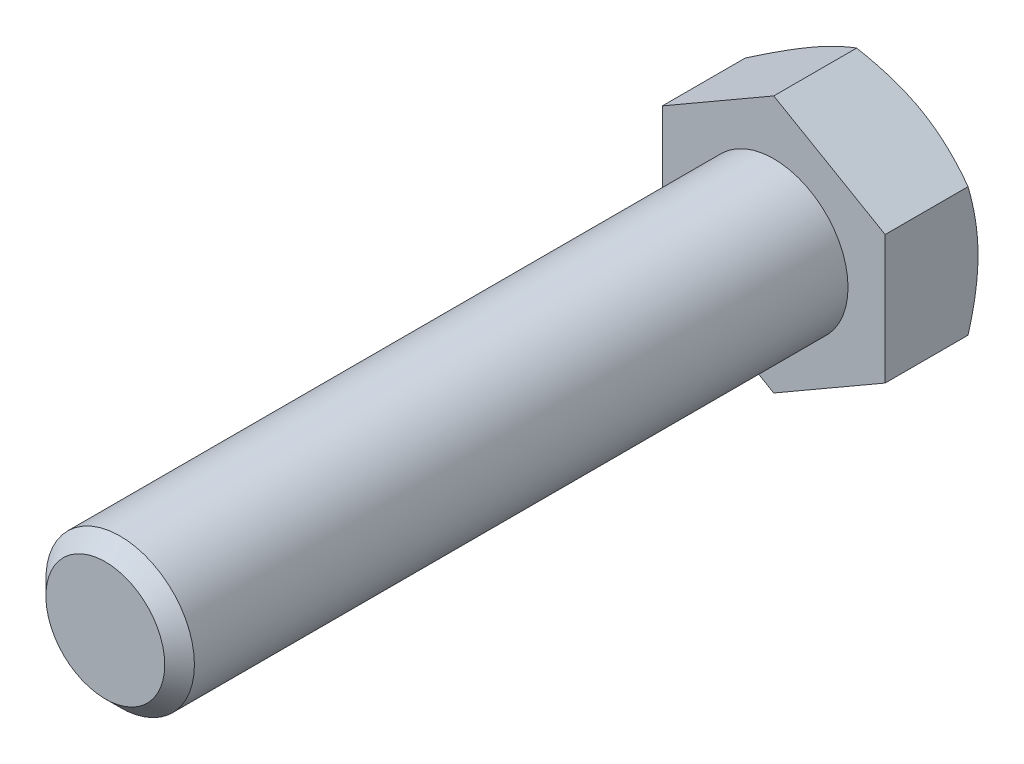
ISO-10303-21;
HEADER;
FILE_DESCRIPTION(('STEP AP214'),'2;1');
FILE_NAME('part.step','',(''),(''),'','','');
FILE_SCHEMA(('AUTOMOTIVE_DESIGN { 1 0 10303 214 1 1 1 1 }'));
ENDSEC;
DATA;
#1=APPLICATION_CONTEXT('core data for automotive mechanical design processes');
#2=APPLICATION_PROTOCOL_DEFINITION('international standard','automotive_design',2000,#1);
#3=PRODUCT_CONTEXT('',#1,'mechanical');
#4=PRODUCT('Part','Part','',(#3));
#5=PRODUCT_RELATED_PRODUCT_CATEGORY('part','',(#4));
#6=PRODUCT_DEFINITION_FORMATION('','',#4);
#7=PRODUCT_DEFINITION_CONTEXT('part definition',#1,'design');
#8=PRODUCT_DEFINITION('design','',#6,#7);
#9=PRODUCT_DEFINITION_SHAPE('','',#8);
#10=(LENGTH_UNIT() NAMED_UNIT(*) SI_UNIT(.MILLI.,.METRE.));
#11=(NAMED_UNIT(*) PLANE_ANGLE_UNIT() SI_UNIT($,.RADIAN.));
#12=(NAMED_UNIT(*) SI_UNIT($,.STERADIAN.) SOLID_ANGLE_UNIT());
#13=UNCERTAINTY_MEASURE_WITH_UNIT(LENGTH_MEASURE(1.E-05),#10,'distance_accuracy_value','');
#14=(GEOMETRIC_REPRESENTATION_CONTEXT(3) GLOBAL_UNCERTAINTY_ASSIGNED_CONTEXT((#13)) GLOBAL_UNIT_ASSIGNED_CONTEXT((#10,
#11,#12)) REPRESENTATION_CONTEXT('',''));
#15=CARTESIAN_POINT('',(0.,0.,0.));
#16=DIRECTION('',(0.,0.,1.));
#17=DIRECTION('',(1.,0.,0.));
#18=AXIS2_PLACEMENT_3D('',#15,#16,#17);
#19=CARTESIAN_POINT('',(0.,0.,90.));
#20=DIRECTION('',(0.,0.,1.));
#21=DIRECTION('',(1.,0.,0.));
#22=AXIS2_PLACEMENT_3D('',#19,#20,#21);
#23=PLANE('',#22);
#24=CARTESIAN_POINT('',(0.,0.,90.));
#25=DIRECTION('',(0.,0.,1.));
#26=DIRECTION('',(1.,0.,0.));
#27=AXIS2_PLACEMENT_3D('',#24,#25,#26);
#28=CIRCLE('',#27,8.00000000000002);
#29=CARTESIAN_POINT('',(8.00000000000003,0.,90.));
#30=VERTEX_POINT('',#29);
#31=EDGE_CURVE('E203',#30,#30,#28,.T.);
#32=ORIENTED_EDGE('',*,*,#31,.T.);
#33=EDGE_LOOP('',(#32));
#34=FACE_BOUND('',#33,.T.);
#35=ADVANCED_FACE('F29',(#34),#23,.T.);
#36=CARTESIAN_POINT('',(0.,0.,0.));
#37=DIRECTION('',(0.,0.,1.));
#38=DIRECTION('',(1.,0.,0.));
#39=AXIS2_PLACEMENT_3D('',#36,#37,#38);
#40=CYLINDRICAL_SURFACE('',#39,10.);
#41=CARTESIAN_POINT('',(0.,0.,88.));
#42=DIRECTION('',(0.,0.,1.));
#43=DIRECTION('',(1.,0.,0.));
#44=AXIS2_PLACEMENT_3D('',#41,#42,#43);
#45=CIRCLE('',#44,10.);
#46=CARTESIAN_POINT('',(10.,0.,88.));
#47=VERTEX_POINT('',#46);
#48=EDGE_CURVE('E205',#47,#47,#45,.F.);
#49=ORIENTED_EDGE('',*,*,#48,.T.);
#50=EDGE_LOOP('',(#49));
#51=FACE_BOUND('',#50,.T.);
#52=CARTESIAN_POINT('',(0.,0.,0.));
#53=DIRECTION('',(0.,0.,1.));
#54=DIRECTION('',(1.,0.,0.));
#55=AXIS2_PLACEMENT_3D('',#52,#53,#54);
#56=CIRCLE('',#55,10.);
#57=CARTESIAN_POINT('',(10.,0.,0.));
#58=VERTEX_POINT('',#57);
#59=EDGE_CURVE('E206',#58,#58,#56,.F.);
#60=ORIENTED_EDGE('',*,*,#59,.F.);
#61=EDGE_LOOP('',(#60));
#62=FACE_BOUND('',#61,.T.);
#63=ADVANCED_FACE('F194',(#51,#62),#40,.T.);
#64=CARTESIAN_POINT('',(0.,0.,90.));
#65=DIRECTION('',(0.,0.,-1.));
#66=DIRECTION('',(-1.,0.,0.));
#67=AXIS2_PLACEMENT_3D('',#64,#65,#66);
#68=CONICAL_SURFACE('',#67,8.00000000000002,0.785398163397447);
#69=ORIENTED_EDGE('',*,*,#48,.F.);
#70=EDGE_LOOP('',(#69));
#71=FACE_BOUND('',#70,.T.);
#72=ORIENTED_EDGE('',*,*,#31,.F.);
#73=EDGE_LOOP('',(#72));
#74=FACE_BOUND('',#73,.T.);
#75=ADVANCED_FACE('F199',(#71,#74),#68,.T.);
#76=CARTESIAN_POINT('',(0.,17.3205080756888,-12.5));
#77=DIRECTION('',(0.499999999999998,0.86602540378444,0.));
#78=DIRECTION('',(-0.86602540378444,0.499999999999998,0.));
#79=AXIS2_PLACEMENT_3D('',#76,#77,#78);
#80=PLANE('',#79);
#81=CARTESIAN_POINT('',(-0.000200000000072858,17.3206235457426,-11.160187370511));
#82=CARTESIAN_POINT('',(0.329494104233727,17.130274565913,-11.270078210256));
#83=CARTESIAN_POINT('',(0.660474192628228,16.939183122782,-11.3749824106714));
#84=CARTESIAN_POINT('',(1.32508844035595,16.5554679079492,-11.5734314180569));
#85=CARTESIAN_POINT('',(1.65872343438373,16.3628436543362,-11.6669724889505));
#86=CARTESIAN_POINT('',(2.32929228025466,15.9756905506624,-11.8414378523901));
#87=CARTESIAN_POINT('',(2.66623200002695,15.7811583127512,-11.9223322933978));
#88=CARTESIAN_POINT('',(3.34245276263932,15.3907420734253,-12.0697673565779));
#89=CARTESIAN_POINT('',(3.68173367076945,15.1948581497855,-12.1363087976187));
#90=CARTESIAN_POINT('',(4.35394314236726,14.8067578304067,-12.2522076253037));
#91=CARTESIAN_POINT('',(4.68682180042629,14.6145702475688,-12.3019486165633));
#92=CARTESIAN_POINT('',(5.35410443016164,14.2293144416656,-12.3853532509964));
#93=CARTESIAN_POINT('',(5.68850843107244,14.0362462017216,-12.4190165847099));
#94=CARTESIAN_POINT('',(6.3578781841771,13.6497853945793,-12.4694159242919));
#95=CARTESIAN_POINT('',(6.6928427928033,13.4563934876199,-12.486172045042));
#96=CARTESIAN_POINT('',(7.36308121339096,13.0694311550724,-12.502396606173));
#97=CARTESIAN_POINT('',(7.6983550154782,12.8758607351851,-12.5018655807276));
#98=CARTESIAN_POINT('',(8.32514688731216,12.5139822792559,-12.4847233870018));
#99=CARTESIAN_POINT('',(8.61670962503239,12.3456484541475,-12.470203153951));
#100=CARTESIAN_POINT('',(9.19916443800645,12.0093680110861,-12.4283628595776));
#101=CARTESIAN_POINT('',(9.49005646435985,11.8414214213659,-12.4010418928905));
#102=CARTESIAN_POINT('',(10.0710118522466,11.5060066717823,-12.3340764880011));
#103=CARTESIAN_POINT('',(10.3610743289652,11.338539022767,-12.2944218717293));
#104=CARTESIAN_POINT('',(10.939839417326,11.0043888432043,-12.2034848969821));
#105=CARTESIAN_POINT('',(11.2285419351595,10.8377063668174,-12.1522017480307));
#106=CARTESIAN_POINT('',(12.1049144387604,10.3317324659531,-11.9796131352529));
#107=CARTESIAN_POINT('',(12.6900465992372,9.99390625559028,-11.8410988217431));
#108=CARTESIAN_POINT('',(13.8515859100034,9.32329122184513,-11.5267280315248));
#109=CARTESIAN_POINT('',(14.4280079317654,8.99049381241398,-11.3509453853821));
#110=CARTESIAN_POINT('',(15.0002,8.66013856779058,-11.160187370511));
#111=B_SPLINE_CURVE_WITH_KNOTS('',3,(#81,#82,#83,#84,#85,#86,#87,#88,#89,#90,#91,#92,#93,#94,
#95,#96,#97,#98,#99,#100,#101,#102,#103,#104,#105,#106,#107,#108,#109,#110),.UNSPECIFIED.,.F.,
.F.,(4,2,2,2,2,2,2,2,2,2,2,2,2,2,4),(0.,1.18875411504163,2.37789802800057,3.56980778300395,
4.76164951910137,5.9240737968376,7.08652044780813,8.2475824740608,9.40860862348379,
10.4193068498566,11.4300765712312,12.4416826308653,13.4533574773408,15.5211962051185,
17.5849760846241),.UNSPECIFIED.);
#112=CARTESIAN_POINT('',(0.,17.3205080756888,-11.1602540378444));
#113=VERTEX_POINT('',#112);
#114=CARTESIAN_POINT('',(7.49999999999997,12.9903810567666,-12.5));
#115=VERTEX_POINT('',#114);
#116=EDGE_CURVE('E239',#113,#115,#111,.T.);
#117=ORIENTED_EDGE('',*,*,#116,.F.);
#118=DIRECTION('',(0.,0.,1.));
#119=VECTOR('',#118,1.);
#120=CARTESIAN_POINT('',(0.,17.3205080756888,-12.5));
#121=LINE('',#120,#119);
#122=CARTESIAN_POINT('',(0.,17.3205080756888,0.));
#123=VERTEX_POINT('',#122);
#124=EDGE_CURVE('E213',#113,#123,#121,.T.);
#125=ORIENTED_EDGE('',*,*,#124,.T.);
#126=DIRECTION('',(-0.86602540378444,0.499999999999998,0.));
#127=VECTOR('',#126,1.);
#128=CARTESIAN_POINT('',(0.,17.3205080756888,0.));
#129=LINE('',#128,#127);
#130=CARTESIAN_POINT('',(15.,8.66025403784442,0.));
#131=VERTEX_POINT('',#130);
#132=EDGE_CURVE('E237',#131,#123,#129,.T.);
#133=ORIENTED_EDGE('',*,*,#132,.F.);
#134=DIRECTION('',(0.,0.,1.));
#135=VECTOR('',#134,1.);
#136=CARTESIAN_POINT('',(15.,8.66025403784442,-12.5));
#137=LINE('',#136,#135);
#138=CARTESIAN_POINT('',(15.,8.66025403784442,-11.1602540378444));
#139=VERTEX_POINT('',#138);
#140=EDGE_CURVE('E210',#139,#131,#137,.T.);
#141=ORIENTED_EDGE('',*,*,#140,.F.);
#142=EDGE_CURVE('E169',#115,#139,#111,.T.);
#143=ORIENTED_EDGE('',*,*,#142,.F.);
#144=EDGE_LOOP('',(#117,#125,#133,#141,#143));
#145=FACE_BOUND('',#144,.T.);
#146=ADVANCED_FACE('F179',(#145),#80,.T.);
#147=CARTESIAN_POINT('',(15.,-8.66025403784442,-12.5));
#148=DIRECTION('',(1.,0.,0.));
#149=DIRECTION('',(0.,0.,-1.));
#150=AXIS2_PLACEMENT_3D('',#147,#148,#149);
#151=PLANE('',#150);
#152=CARTESIAN_POINT('',(15.,-23.656342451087,-4.98802951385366));
#153=CARTESIAN_POINT('',(15.,-23.3270368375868,-5.14859323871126));
#154=CARTESIAN_POINT('',(15.,-22.9973552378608,-5.30838548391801));
#155=CARTESIAN_POINT('',(15.,-22.3371617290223,-5.62625300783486));
#156=CARTESIAN_POINT('',(15.,-22.00664981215,-5.7843282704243));
#157=CARTESIAN_POINT('',(15.,-21.0136682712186,-6.25575678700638));
#158=CARTESIAN_POINT('',(15.,-20.3498444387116,-6.56626799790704));
#159=CARTESIAN_POINT('',(15.,-19.0144565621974,-7.1794948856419));
#160=CARTESIAN_POINT('',(15.,-18.3428702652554,-7.48216221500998));
#161=CARTESIAN_POINT('',(15.,-16.9944919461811,-8.07562821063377));
#162=CARTESIAN_POINT('',(15.,-16.3177001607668,-8.36642741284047));
#163=CARTESIAN_POINT('',(15.,-14.9346939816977,-8.9426707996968));
#164=CARTESIAN_POINT('',(15.,-14.2282621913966,-9.22759584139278));
#165=CARTESIAN_POINT('',(15.,-12.8072761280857,-9.77682099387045));
#166=CARTESIAN_POINT('',(15.,-12.0927209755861,-10.0411188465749));
#167=CARTESIAN_POINT('',(15.,-10.6555877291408,-10.5424349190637));
#168=CARTESIAN_POINT('',(15.,-9.93302789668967,-10.7795050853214));
#169=CARTESIAN_POINT('',(15.,-8.47748492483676,-11.2190363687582));
#170=CARTESIAN_POINT('',(15.,-7.74450501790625,-11.4215079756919));
#171=CARTESIAN_POINT('',(15.,-6.63906626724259,-11.691591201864));
#172=CARTESIAN_POINT('',(15.,-6.2706460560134,-11.7758229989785));
#173=CARTESIAN_POINT('',(15.,-5.53121828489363,-11.9321086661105));
#174=CARTESIAN_POINT('',(15.,-5.1602107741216,-12.0041627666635));
#175=CARTESIAN_POINT('',(15.,-4.41583632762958,-12.1348466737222));
#176=CARTESIAN_POINT('',(15.,-4.04246944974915,-12.1934768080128));
#177=CARTESIAN_POINT('',(15.,-3.29373978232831,-12.2961594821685));
#178=CARTESIAN_POINT('',(15.,-2.91837708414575,-12.3402126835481));
#179=CARTESIAN_POINT('',(15.,-2.17125057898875,-12.4122914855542));
#180=CARTESIAN_POINT('',(15.,-1.7995071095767,-12.4405265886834));
#181=CARTESIAN_POINT('',(15.,-1.0551586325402,-12.4812352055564));
#182=CARTESIAN_POINT('',(15.,-0.682553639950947,-12.4937089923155));
#183=CARTESIAN_POINT('',(15.,0.0628536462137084,-12.5025960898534));
#184=CARTESIAN_POINT('',(15.,0.435655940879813,-12.4990093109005));
#185=CARTESIAN_POINT('',(15.,1.18076829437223,-12.4758669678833));
#186=CARTESIAN_POINT('',(15.,1.55307833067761,-12.456310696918));
#187=CARTESIAN_POINT('',(15.,2.43604587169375,-12.3914173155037));
#188=CARTESIAN_POINT('',(15.,2.94620665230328,-12.3391608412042));
#189=CARTESIAN_POINT('',(15.,3.96297341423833,-12.2074265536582));
#190=CARTESIAN_POINT('',(15.,4.46957894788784,-12.1279453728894));
#191=CARTESIAN_POINT('',(15.,5.98333889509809,-11.8528606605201));
#192=CARTESIAN_POINT('',(15.,6.98394325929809,-11.6206572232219));
#193=CARTESIAN_POINT('',(15.,8.48096930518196,-11.2149672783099));
#194=CARTESIAN_POINT('',(15.,8.98506717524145,-11.0681521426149));
#195=CARTESIAN_POINT('',(15.,9.98837333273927,-10.7585239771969));
#196=CARTESIAN_POINT('',(15.,10.4875815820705,-10.5957108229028));
#197=CARTESIAN_POINT('',(15.,11.4812605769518,-10.2567587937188));
#198=CARTESIAN_POINT('',(15.,11.9757325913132,-10.0806236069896));
#199=CARTESIAN_POINT('',(15.,12.7143247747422,-9.80804005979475));
#200=CARTESIAN_POINT('',(15.,12.9600014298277,-9.71578264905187));
#201=CARTESIAN_POINT('',(15.,13.4503781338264,-9.5287050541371));
#202=CARTESIAN_POINT('',(15.,13.6950781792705,-9.43388486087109));
#203=CARTESIAN_POINT('',(15.,14.359390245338,-9.1727978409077));
#204=CARTESIAN_POINT('',(15.,14.7781022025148,-9.0042384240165));
#205=CARTESIAN_POINT('',(15.,15.6130793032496,-8.6611558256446));
#206=CARTESIAN_POINT('',(15.,16.0293443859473,-8.48663249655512));
#207=CARTESIAN_POINT('',(15.,17.2749256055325,-7.95534410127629));
#208=CARTESIAN_POINT('',(15.,18.1009632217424,-7.59088627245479));
#209=CARTESIAN_POINT('',(15.,19.7463472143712,-6.84641952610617));
#210=CARTESIAN_POINT('',(15.,20.5656908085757,-6.46640450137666));
#211=CARTESIAN_POINT('',(15.,22.1987342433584,-5.6945498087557));
#212=CARTESIAN_POINT('',(15.,23.0124343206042,-5.30271064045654));
#213=CARTESIAN_POINT('',(15.,24.6366504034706,-4.50915614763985));
#214=CARTESIAN_POINT('',(15.,25.4471589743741,-4.1074256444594));
#215=CARTESIAN_POINT('',(15.,27.0645048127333,-3.29663533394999));
#216=CARTESIAN_POINT('',(15.,27.8713420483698,-2.88757546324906));
#217=CARTESIAN_POINT('',(15.,29.481823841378,-2.06366878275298));
#218=CARTESIAN_POINT('',(15.,30.2854690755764,-1.64882329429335));
#219=CARTESIAN_POINT('',(15.,31.890265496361,-0.814347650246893));
#220=CARTESIAN_POINT('',(15.,32.691416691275,-0.39471751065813));
#221=CARTESIAN_POINT('',(15.,34.9203498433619,0.77972707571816));
#222=CARTESIAN_POINT('',(15.,36.3458714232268,1.53883048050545));
#223=CARTESIAN_POINT('',(15.,39.1921522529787,3.06610948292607));
#224=CARTESIAN_POINT('',(15.,40.6129111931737,3.83428565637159));
#225=CARTESIAN_POINT('',(15.,43.445900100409,5.37475686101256));
#226=CARTESIAN_POINT('',(15.,44.8581426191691,6.14702882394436));
#227=CARTESIAN_POINT('',(15.,46.9743278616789,7.30926449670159));
#228=CARTESIAN_POINT('',(15.,47.6793316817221,7.6972987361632));
#229=CARTESIAN_POINT('',(15.,49.08870787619,8.47451029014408));
#230=CARTESIAN_POINT('',(15.,49.7930802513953,8.8636876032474));
#231=CARTESIAN_POINT('',(15.,50.4971756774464,9.2533654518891));
#232=B_SPLINE_CURVE_WITH_KNOTS('',3,(#152,#153,#154,#155,#156,#157,#158,#159,#160,#161,#162,
#163,#164,#165,#166,#167,#168,#169,#170,#171,#172,#173,#174,#175,#176,#177,#178,#179,#180,#181,
#182,#183,#184,#185,#186,#187,#188,#189,#190,#191,#192,#193,#194,#195,#196,#197,#198,#199,#200,
#201,#202,#203,#204,#205,#206,#207,#208,#209,#210,#211,#212,#213,#214,#215,#216,#217,#218,#219,
#220,#221,#222,#223,#224,#225,#226,#227,#228,#229,#230,#231),.UNSPECIFIED.,.F.,.F.,(4,2,2,2,2,2,
2,2,2,2,2,2,2,2,2,2,2,2,2,2,2,2,2,2,2,2,2,2,2,2,2,2,2,2,2,2,2,2,2,4),(0.,1.09909142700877,
2.19819316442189,4.39670244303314,6.60652703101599,8.81625171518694,11.1011868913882,
13.3863718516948,15.667121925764,17.9471792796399,19.0807901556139,20.2143795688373,
21.3479412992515,22.4814515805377,23.5995709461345,24.7176709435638,25.8357771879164,
26.9539329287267,28.4915630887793,30.0293835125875,33.1065029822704,34.6814865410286,
36.2564823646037,37.8310437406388,38.618315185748,39.4055894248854,40.7596309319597,
42.1137059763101,44.8220642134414,47.5314960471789,50.2408135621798,52.9545856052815,
55.668381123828,58.3815666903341,61.0947431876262,65.939807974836,70.7851819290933,
75.6139863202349,78.0281952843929,80.4424012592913),.UNSPECIFIED.);
#233=CARTESIAN_POINT('',(15.,0.,-12.5));
#234=VERTEX_POINT('',#233);
#235=EDGE_CURVE('E167',#139,#234,#232,.F.);
#236=ORIENTED_EDGE('',*,*,#235,.F.);
#237=ORIENTED_EDGE('',*,*,#140,.T.);
#238=DIRECTION('',(0.,1.,0.));
#239=VECTOR('',#238,1.);
#240=CARTESIAN_POINT('',(15.,-8.66025403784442,0.));
#241=LINE('',#240,#239);
#242=CARTESIAN_POINT('',(15.,-8.66025403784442,0.));
#243=VERTEX_POINT('',#242);
#244=EDGE_CURVE('E215',#243,#131,#241,.T.);
#245=ORIENTED_EDGE('',*,*,#244,.F.);
#246=DIRECTION('',(0.,0.,1.));
#247=VECTOR('',#246,1.);
#248=CARTESIAN_POINT('',(15.,-8.66025403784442,-12.5));
#249=LINE('',#248,#247);
#250=CARTESIAN_POINT('',(15.,-8.66025403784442,-11.1602540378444));
#251=VERTEX_POINT('',#250);
#252=EDGE_CURVE('E221',#251,#243,#249,.T.);
#253=ORIENTED_EDGE('',*,*,#252,.F.);
#254=EDGE_CURVE('E162',#234,#251,#232,.F.);
#255=ORIENTED_EDGE('',*,*,#254,.F.);
#256=EDGE_LOOP('',(#236,#237,#245,#253,#255));
#257=FACE_BOUND('',#256,.T.);
#258=ADVANCED_FACE('F175',(#257),#151,.T.);
#259=CARTESIAN_POINT('',(0.,-17.3205080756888,-12.5));
#260=DIRECTION('',(0.499999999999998,-0.86602540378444,0.));
#261=DIRECTION('',(0.86602540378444,0.499999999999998,0.));
#262=AXIS2_PLACEMENT_3D('',#259,#260,#261);
#263=PLANE('',#262);
#264=CARTESIAN_POINT('',(15.0002,-8.66013856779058,-11.160187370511));
#265=CARTESIAN_POINT('',(14.6705058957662,-8.85048754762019,-11.2700782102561));
#266=CARTESIAN_POINT('',(14.3395258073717,-9.04157899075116,-11.3749824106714));
#267=CARTESIAN_POINT('',(13.674911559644,-9.42529420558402,-11.5734314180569));
#268=CARTESIAN_POINT('',(13.3412765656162,-9.61791845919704,-11.6669724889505));
#269=CARTESIAN_POINT('',(12.6707077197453,-10.0050715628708,-11.8414378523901));
#270=CARTESIAN_POINT('',(12.333767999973,-10.199603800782,-11.9223322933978));
#271=CARTESIAN_POINT('',(11.6575472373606,-10.5900200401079,-12.069767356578));
#272=CARTESIAN_POINT('',(11.3182663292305,-10.7859039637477,-12.1363087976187));
#273=CARTESIAN_POINT('',(10.6460568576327,-11.1740042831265,-12.2522076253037));
#274=CARTESIAN_POINT('',(10.3131781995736,-11.3661918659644,-12.3019486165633));
#275=CARTESIAN_POINT('',(9.64589556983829,-11.7514476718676,-12.3853532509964));
#276=CARTESIAN_POINT('',(9.31149156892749,-11.9445159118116,-12.4190165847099));
#277=CARTESIAN_POINT('',(8.64212181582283,-12.3309767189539,-12.4694159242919));
#278=CARTESIAN_POINT('',(8.30715720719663,-12.5243686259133,-12.486172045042));
#279=CARTESIAN_POINT('',(7.63691878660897,-12.9113309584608,-12.502396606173));
#280=CARTESIAN_POINT('',(7.30164498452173,-13.1049013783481,-12.5018655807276));
#281=CARTESIAN_POINT('',(6.67485311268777,-13.4667798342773,-12.4847233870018));
#282=CARTESIAN_POINT('',(6.38329037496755,-13.6351136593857,-12.470203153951));
#283=CARTESIAN_POINT('',(5.80083556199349,-13.9713941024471,-12.4283628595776));
#284=CARTESIAN_POINT('',(5.50994353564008,-14.1393406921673,-12.4010418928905));
#285=CARTESIAN_POINT('',(4.92898814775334,-14.4747554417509,-12.3340764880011));
#286=CARTESIAN_POINT('',(4.63892567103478,-14.6422230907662,-12.2944218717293));
#287=CARTESIAN_POINT('',(4.06016058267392,-14.9763732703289,-12.2034848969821));
#288=CARTESIAN_POINT('',(3.77145806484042,-15.1430557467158,-12.1522017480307));
#289=CARTESIAN_POINT('',(2.89508556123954,-15.6490296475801,-11.9796131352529));
#290=CARTESIAN_POINT('',(2.30995340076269,-15.9868558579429,-11.8410988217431));
#291=CARTESIAN_POINT('',(1.14841408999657,-16.6574708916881,-11.5267280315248));
#292=CARTESIAN_POINT('',(0.571992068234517,-16.9902683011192,-11.3509453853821));
#293=CARTESIAN_POINT('',(-0.000200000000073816,-17.3206235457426,-11.160187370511));
#294=B_SPLINE_CURVE_WITH_KNOTS('',3,(#264,#265,#266,#267,#268,#269,#270,#271,#272,#273,#274,
#275,#276,#277,#278,#279,#280,#281,#282,#283,#284,#285,#286,#287,#288,#289,#290,#291,#292,#293),
.UNSPECIFIED.,.F.,.F.,(4,2,2,2,2,2,2,2,2,2,2,2,2,2,4),(0.,1.18875411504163,2.37789802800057,
3.56980778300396,4.76164951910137,5.9240737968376,7.08652044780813,8.2475824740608,
9.40860862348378,10.4193068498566,11.4300765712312,12.4416826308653,13.4533574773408,
15.5211962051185,17.5849760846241),.UNSPECIFIED.);
#295=CARTESIAN_POINT('',(7.49999999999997,-12.9903810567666,-12.5));
#296=VERTEX_POINT('',#295);
#297=EDGE_CURVE('E168',#251,#296,#294,.T.);
#298=ORIENTED_EDGE('',*,*,#297,.F.);
#299=ORIENTED_EDGE('',*,*,#252,.T.);
#300=DIRECTION('',(0.86602540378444,0.499999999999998,0.));
#301=VECTOR('',#300,1.);
#302=CARTESIAN_POINT('',(0.,-17.3205080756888,0.));
#303=LINE('',#302,#301);
#304=CARTESIAN_POINT('',(0.,-17.3205080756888,0.));
#305=VERTEX_POINT('',#304);
#306=EDGE_CURVE('E226',#305,#243,#303,.T.);
#307=ORIENTED_EDGE('',*,*,#306,.F.);
#308=DIRECTION('',(0.,0.,1.));
#309=VECTOR('',#308,1.);
#310=CARTESIAN_POINT('',(0.,-17.3205080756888,-12.5));
#311=LINE('',#310,#309);
#312=CARTESIAN_POINT('',(0.,-17.3205080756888,-11.1602540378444));
#313=VERTEX_POINT('',#312);
#314=EDGE_CURVE('E219',#313,#305,#311,.T.);
#315=ORIENTED_EDGE('',*,*,#314,.F.);
#316=EDGE_CURVE('E156',#296,#313,#294,.T.);
#317=ORIENTED_EDGE('',*,*,#316,.F.);
#318=EDGE_LOOP('',(#298,#299,#307,#315,#317));
#319=FACE_BOUND('',#318,.T.);
#320=ADVANCED_FACE('F178',(#319),#263,.T.);
#321=CARTESIAN_POINT('',(0.,-17.3205080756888,-12.5));
#322=DIRECTION('',(-0.500000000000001,-0.866025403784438,0.));
#323=DIRECTION('',(0.866025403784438,-0.500000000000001,0.));
#324=AXIS2_PLACEMENT_3D('',#321,#322,#323);
#325=PLANE('',#324);
#326=CARTESIAN_POINT('',(0.000199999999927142,-17.3206235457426,-11.160187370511));
#327=CARTESIAN_POINT('',(-0.329494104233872,-17.130274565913,-11.270078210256));
#328=CARTESIAN_POINT('',(-0.660474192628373,-16.939183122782,-11.3749824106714));
#329=CARTESIAN_POINT('',(-1.32508844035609,-16.5554679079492,-11.5734314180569));
#330=CARTESIAN_POINT('',(-1.65872343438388,-16.3628436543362,-11.6669724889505));
#331=CARTESIAN_POINT('',(-2.32929228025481,-15.9756905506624,-11.8414378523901));
#332=CARTESIAN_POINT('',(-2.66623200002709,-15.7811583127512,-11.9223322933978));
#333=CARTESIAN_POINT('',(-3.34245276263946,-15.3907420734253,-12.0697673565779));
#334=CARTESIAN_POINT('',(-3.68173367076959,-15.1948581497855,-12.1363087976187));
#335=CARTESIAN_POINT('',(-4.3539431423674,-14.8067578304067,-12.2522076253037));
#336=CARTESIAN_POINT('',(-4.68682180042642,-14.6145702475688,-12.3019486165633));
#337=CARTESIAN_POINT('',(-5.35410443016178,-14.2293144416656,-12.3853532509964));
#338=CARTESIAN_POINT('',(-5.68850843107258,-14.0362462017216,-12.4190165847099));
#339=CARTESIAN_POINT('',(-6.35787818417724,-13.6497853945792,-12.4694159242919));
#340=CARTESIAN_POINT('',(-6.69284279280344,-13.4563934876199,-12.4861720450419));
#341=CARTESIAN_POINT('',(-7.36308121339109,-13.0694311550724,-12.502396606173));
#342=CARTESIAN_POINT('',(-7.69835501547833,-12.8758607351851,-12.5018655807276));
#343=CARTESIAN_POINT('',(-8.32514688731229,-12.5139822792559,-12.4847233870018));
#344=CARTESIAN_POINT('',(-8.61670962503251,-12.3456484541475,-12.470203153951));
#345=CARTESIAN_POINT('',(-9.19916443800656,-12.0093680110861,-12.4283628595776));
#346=CARTESIAN_POINT('',(-9.49005646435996,-11.8414214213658,-12.4010418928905));
#347=CARTESIAN_POINT('',(-10.0710118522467,-11.5060066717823,-12.3340764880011));
#348=CARTESIAN_POINT('',(-10.3610743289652,-11.338539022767,-12.2944218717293));
#349=CARTESIAN_POINT('',(-10.9398394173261,-11.0043888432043,-12.2034848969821));
#350=CARTESIAN_POINT('',(-11.2285419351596,-10.8377063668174,-12.1522017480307));
#351=CARTESIAN_POINT('',(-12.1049144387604,-10.3317324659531,-11.9796131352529));
#352=CARTESIAN_POINT('',(-12.6900465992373,-9.99390625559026,-11.841098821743));
#353=CARTESIAN_POINT('',(-13.8515859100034,-9.32329122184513,-11.5267280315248));
#354=CARTESIAN_POINT('',(-14.4280079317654,-8.99049381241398,-11.3509453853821));
#355=CARTESIAN_POINT('',(-15.0002,-8.66013856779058,-11.160187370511));
#356=B_SPLINE_CURVE_WITH_KNOTS('',3,(#326,#327,#328,#329,#330,#331,#332,#333,#334,#335,#336,
#337,#338,#339,#340,#341,#342,#343,#344,#345,#346,#347,#348,#349,#350,#351,#352,#353,#354,#355),
.UNSPECIFIED.,.F.,.F.,(4,2,2,2,2,2,2,2,2,2,2,2,2,2,4),(0.,1.18875411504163,2.37789802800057,
3.56980778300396,4.76164951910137,5.9240737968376,7.08652044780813,8.2475824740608,
9.40860862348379,10.4193068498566,11.4300765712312,12.4416826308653,13.4533574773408,
15.5211962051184,17.584976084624),.UNSPECIFIED.);
#357=CARTESIAN_POINT('',(-7.50000000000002,-12.9903810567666,-12.5));
#358=VERTEX_POINT('',#357);
#359=EDGE_CURVE('E258',#313,#358,#356,.T.);
#360=ORIENTED_EDGE('',*,*,#359,.F.);
#361=ORIENTED_EDGE('',*,*,#314,.T.);
#362=DIRECTION('',(0.866025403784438,-0.500000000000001,0.));
#363=VECTOR('',#362,1.);
#364=CARTESIAN_POINT('',(0.,-17.3205080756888,0.));
#365=LINE('',#364,#363);
#366=CARTESIAN_POINT('',(-15.,-8.66025403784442,0.));
#367=VERTEX_POINT('',#366);
#368=EDGE_CURVE('E229',#367,#305,#365,.T.);
#369=ORIENTED_EDGE('',*,*,#368,.F.);
#370=DIRECTION('',(0.,0.,1.));
#371=VECTOR('',#370,1.);
#372=CARTESIAN_POINT('',(-15.,-8.66025403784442,-12.5));
#373=LINE('',#372,#371);
#374=CARTESIAN_POINT('',(-15.,-8.66025403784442,-11.1602540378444));
#375=VERTEX_POINT('',#374);
#376=EDGE_CURVE('E217',#375,#367,#373,.T.);
#377=ORIENTED_EDGE('',*,*,#376,.F.);
#378=EDGE_CURVE('E105',#358,#375,#356,.T.);
#379=ORIENTED_EDGE('',*,*,#378,.F.);
#380=EDGE_LOOP('',(#360,#361,#369,#377,#379));
#381=FACE_BOUND('',#380,.T.);
#382=ADVANCED_FACE('F183',(#381),#325,.T.);
#383=CARTESIAN_POINT('',(-15.,-8.66025403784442,-12.5));
#384=DIRECTION('',(-1.,0.,0.));
#385=DIRECTION('',(0.,0.,1.));
#386=AXIS2_PLACEMENT_3D('',#383,#384,#385);
#387=PLANE('',#386);
#388=CARTESIAN_POINT('',(-15.,-23.656342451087,-4.98802951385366));
#389=CARTESIAN_POINT('',(-15.,-23.3270368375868,-5.14859323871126));
#390=CARTESIAN_POINT('',(-15.,-22.9973552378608,-5.30838548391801));
#391=CARTESIAN_POINT('',(-15.,-22.3371617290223,-5.62625300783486));
#392=CARTESIAN_POINT('',(-15.,-22.00664981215,-5.7843282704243));
#393=CARTESIAN_POINT('',(-15.,-21.0136682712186,-6.25575678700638));
#394=CARTESIAN_POINT('',(-15.,-20.3498444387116,-6.56626799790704));
#395=CARTESIAN_POINT('',(-15.,-19.0144565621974,-7.1794948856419));
#396=CARTESIAN_POINT('',(-15.,-18.3428702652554,-7.48216221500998));
#397=CARTESIAN_POINT('',(-15.,-16.9944919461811,-8.07562821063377));
#398=CARTESIAN_POINT('',(-15.,-16.3177001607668,-8.36642741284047));
#399=CARTESIAN_POINT('',(-15.,-14.9346939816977,-8.9426707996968));
#400=CARTESIAN_POINT('',(-15.,-14.2282621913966,-9.22759584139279));
#401=CARTESIAN_POINT('',(-15.,-12.8072761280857,-9.77682099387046));
#402=CARTESIAN_POINT('',(-15.,-12.0927209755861,-10.0411188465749));
#403=CARTESIAN_POINT('',(-15.,-10.6555877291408,-10.5424349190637));
#404=CARTESIAN_POINT('',(-15.,-9.93302789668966,-10.7795050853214));
#405=CARTESIAN_POINT('',(-15.,-8.47748492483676,-11.2190363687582));
#406=CARTESIAN_POINT('',(-15.,-7.74450501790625,-11.4215079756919));
#407=CARTESIAN_POINT('',(-15.,-6.63906626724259,-11.691591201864));
#408=CARTESIAN_POINT('',(-15.,-6.2706460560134,-11.7758229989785));
#409=CARTESIAN_POINT('',(-15.,-5.53121828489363,-11.9321086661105));
#410=CARTESIAN_POINT('',(-15.,-5.1602107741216,-12.0041627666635));
#411=CARTESIAN_POINT('',(-15.,-4.41583632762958,-12.1348466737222));
#412=CARTESIAN_POINT('',(-15.,-4.04246944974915,-12.1934768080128));
#413=CARTESIAN_POINT('',(-15.,-3.29373978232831,-12.2961594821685));
#414=CARTESIAN_POINT('',(-15.,-2.91837708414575,-12.3402126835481));
#415=CARTESIAN_POINT('',(-15.,-2.17125057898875,-12.4122914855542));
#416=CARTESIAN_POINT('',(-15.,-1.7995071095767,-12.4405265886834));
#417=CARTESIAN_POINT('',(-15.,-1.05515863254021,-12.4812352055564));
#418=CARTESIAN_POINT('',(-15.,-0.68255363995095,-12.4937089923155));
#419=CARTESIAN_POINT('',(-15.,0.0628536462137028,-12.5025960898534));
#420=CARTESIAN_POINT('',(-15.,0.435655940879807,-12.4990093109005));
#421=CARTESIAN_POINT('',(-15.,1.18076829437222,-12.4758669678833));
#422=CARTESIAN_POINT('',(-15.,1.5530783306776,-12.456310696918));
#423=CARTESIAN_POINT('',(-15.,2.43604587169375,-12.3914173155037));
#424=CARTESIAN_POINT('',(-15.,2.94620665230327,-12.3391608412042));
#425=CARTESIAN_POINT('',(-15.,3.96297341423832,-12.2074265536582));
#426=CARTESIAN_POINT('',(-15.,4.46957894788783,-12.1279453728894));
#427=CARTESIAN_POINT('',(-15.,5.98333889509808,-11.8528606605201));
#428=CARTESIAN_POINT('',(-15.,6.98394325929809,-11.6206572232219));
#429=CARTESIAN_POINT('',(-15.,8.48096930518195,-11.2149672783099));
#430=CARTESIAN_POINT('',(-15.,8.98506717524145,-11.0681521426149));
#431=CARTESIAN_POINT('',(-15.,9.98837333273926,-10.7585239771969));
#432=CARTESIAN_POINT('',(-15.,10.4875815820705,-10.5957108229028));
#433=CARTESIAN_POINT('',(-15.,11.4812605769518,-10.2567587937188));
#434=CARTESIAN_POINT('',(-15.,11.9757325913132,-10.0806236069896));
#435=CARTESIAN_POINT('',(-15.,12.7143247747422,-9.80804005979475));
#436=CARTESIAN_POINT('',(-15.,12.9600014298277,-9.71578264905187));
#437=CARTESIAN_POINT('',(-15.,13.4503781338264,-9.5287050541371));
#438=CARTESIAN_POINT('',(-15.,13.6950781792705,-9.4338848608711));
#439=CARTESIAN_POINT('',(-15.,14.359390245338,-9.1727978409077));
#440=CARTESIAN_POINT('',(-15.,14.7781022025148,-9.00423842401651));
#441=CARTESIAN_POINT('',(-15.,15.6130793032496,-8.6611558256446));
#442=CARTESIAN_POINT('',(-15.,16.0293443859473,-8.48663249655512));
#443=CARTESIAN_POINT('',(-15.,17.2749256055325,-7.95534410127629));
#444=CARTESIAN_POINT('',(-15.,18.1009632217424,-7.59088627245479));
#445=CARTESIAN_POINT('',(-15.,19.7463472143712,-6.84641952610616));
#446=CARTESIAN_POINT('',(-15.,20.5656908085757,-6.46640450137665));
#447=CARTESIAN_POINT('',(-15.,22.1987342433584,-5.69454980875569));
#448=CARTESIAN_POINT('',(-15.,23.0124343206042,-5.30271064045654));
#449=CARTESIAN_POINT('',(-15.,24.6366504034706,-4.50915614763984));
#450=CARTESIAN_POINT('',(-15.,25.4471589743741,-4.10742564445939));
#451=CARTESIAN_POINT('',(-15.,27.0645048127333,-3.29663533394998));
#452=CARTESIAN_POINT('',(-15.,27.8713420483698,-2.88757546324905));
#453=CARTESIAN_POINT('',(-15.,29.4818238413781,-2.06366878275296));
#454=CARTESIAN_POINT('',(-15.,30.2854690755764,-1.64882329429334));
#455=CARTESIAN_POINT('',(-15.,31.890265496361,-0.814347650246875));
#456=CARTESIAN_POINT('',(-15.,32.691416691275,-0.394717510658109));
#457=CARTESIAN_POINT('',(-15.,34.920349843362,0.779727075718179));
#458=CARTESIAN_POINT('',(-15.,36.3458714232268,1.53883048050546));
#459=CARTESIAN_POINT('',(-15.,39.1921522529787,3.06610948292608));
#460=CARTESIAN_POINT('',(-15.,40.6129111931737,3.8342856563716));
#461=CARTESIAN_POINT('',(-15.,43.4459001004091,5.37475686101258));
#462=CARTESIAN_POINT('',(-15.,44.8581426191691,6.14702882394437));
#463=CARTESIAN_POINT('',(-15.,46.9743278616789,7.3092644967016));
#464=CARTESIAN_POINT('',(-15.,47.6793316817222,7.69729873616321));
#465=CARTESIAN_POINT('',(-15.,49.08870787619,8.47451029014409));
#466=CARTESIAN_POINT('',(-15.,49.7930802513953,8.86368760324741));
#467=CARTESIAN_POINT('',(-15.,50.4971756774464,9.25336545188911));
#468=B_SPLINE_CURVE_WITH_KNOTS('',3,(#388,#389,#390,#391,#392,#393,#394,#395,#396,#397,#398,
#399,#400,#401,#402,#403,#404,#405,#406,#407,#408,#409,#410,#411,#412,#413,#414,#415,#416,#417,
#418,#419,#420,#421,#422,#423,#424,#425,#426,#427,#428,#429,#430,#431,#432,#433,#434,#435,#436,
#437,#438,#439,#440,#441,#442,#443,#444,#445,#446,#447,#448,#449,#450,#451,#452,#453,#454,#455,
#456,#457,#458,#459,#460,#461,#462,#463,#464,#465,#466,#467),.UNSPECIFIED.,.F.,.F.,(4,2,2,2,2,2,
2,2,2,2,2,2,2,2,2,2,2,2,2,2,2,2,2,2,2,2,2,2,2,2,2,2,2,2,2,2,2,2,2,4),(0.,1.09909142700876,
2.19819316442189,4.39670244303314,6.606527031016,8.81625171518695,11.1011868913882,
13.3863718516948,15.667121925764,17.9471792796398,19.0807901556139,20.2143795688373,
21.3479412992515,22.4814515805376,23.5995709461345,24.7176709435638,25.8357771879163,
26.9539329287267,28.4915630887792,30.0293835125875,33.1065029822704,34.6814865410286,
36.2564823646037,37.8310437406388,38.6183151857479,39.4055894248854,40.7596309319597,
42.1137059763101,44.8220642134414,47.5314960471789,50.2408135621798,52.9545856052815,
55.6683811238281,58.3815666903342,61.0947431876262,65.939807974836,70.7851819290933,
75.6139863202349,78.0281952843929,80.4424012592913),.UNSPECIFIED.);
#469=CARTESIAN_POINT('',(-15.,0.,-12.5));
#470=VERTEX_POINT('',#469);
#471=EDGE_CURVE('E100',#375,#470,#468,.T.);
#472=ORIENTED_EDGE('',*,*,#471,.F.);
#473=ORIENTED_EDGE('',*,*,#376,.T.);
#474=DIRECTION('',(0.,-1.,0.));
#475=VECTOR('',#474,1.);
#476=CARTESIAN_POINT('',(-15.,-8.66025403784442,0.));
#477=LINE('',#476,#475);
#478=CARTESIAN_POINT('',(-15.,8.66025403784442,0.));
#479=VERTEX_POINT('',#478);
#480=EDGE_CURVE('E232',#479,#367,#477,.T.);
#481=ORIENTED_EDGE('',*,*,#480,.F.);
#482=DIRECTION('',(0.,0.,1.));
#483=VECTOR('',#482,1.);
#484=CARTESIAN_POINT('',(-15.,8.66025403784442,-12.5));
#485=LINE('',#484,#483);
#486=CARTESIAN_POINT('',(-15.,8.66025403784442,-11.1602540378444));
#487=VERTEX_POINT('',#486);
#488=EDGE_CURVE('E126',#487,#479,#485,.T.);
#489=ORIENTED_EDGE('',*,*,#488,.F.);
#490=EDGE_CURVE('E109',#470,#487,#468,.T.);
#491=ORIENTED_EDGE('',*,*,#490,.F.);
#492=EDGE_LOOP('',(#472,#473,#481,#489,#491));
#493=FACE_BOUND('',#492,.T.);
#494=ADVANCED_FACE('F124',(#493),#387,.T.);
#495=CARTESIAN_POINT('',(-15.,8.66025403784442,-12.5));
#496=DIRECTION('',(-0.500000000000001,0.866025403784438,0.));
#497=DIRECTION('',(-0.866025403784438,-0.500000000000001,0.));
#498=AXIS2_PLACEMENT_3D('',#495,#496,#497);
#499=PLANE('',#498);
#500=CARTESIAN_POINT('',(-15.0002,8.66013856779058,-11.160187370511));
#501=CARTESIAN_POINT('',(-14.6705058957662,8.85048754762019,-11.2700782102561));
#502=CARTESIAN_POINT('',(-14.3395258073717,9.04157899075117,-11.3749824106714));
#503=CARTESIAN_POINT('',(-13.674911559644,9.42529420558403,-11.5734314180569));
#504=CARTESIAN_POINT('',(-13.3412765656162,9.61791845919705,-11.6669724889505));
#505=CARTESIAN_POINT('',(-12.6707077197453,10.0050715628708,-11.8414378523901));
#506=CARTESIAN_POINT('',(-12.333767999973,10.199603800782,-11.9223322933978));
#507=CARTESIAN_POINT('',(-11.6575472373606,10.5900200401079,-12.0697673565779));
#508=CARTESIAN_POINT('',(-11.3182663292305,10.7859039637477,-12.1363087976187));
#509=CARTESIAN_POINT('',(-10.6460568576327,11.1740042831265,-12.2522076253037));
#510=CARTESIAN_POINT('',(-10.3131781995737,11.3661918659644,-12.3019486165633));
#511=CARTESIAN_POINT('',(-9.6458955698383,11.7514476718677,-12.3853532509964));
#512=CARTESIAN_POINT('',(-9.3114915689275,11.9445159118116,-12.4190165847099));
#513=CARTESIAN_POINT('',(-8.64212181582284,12.330976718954,-12.4694159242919));
#514=CARTESIAN_POINT('',(-8.30715720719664,12.5243686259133,-12.4861720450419));
#515=CARTESIAN_POINT('',(-7.63691878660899,12.9113309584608,-12.502396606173));
#516=CARTESIAN_POINT('',(-7.30164498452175,13.1049013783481,-12.5018655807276));
#517=CARTESIAN_POINT('',(-6.67485311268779,13.4667798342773,-12.4847233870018));
#518=CARTESIAN_POINT('',(-6.38329037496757,13.6351136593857,-12.470203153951));
#519=CARTESIAN_POINT('',(-5.80083556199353,13.9713941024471,-12.4283628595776));
#520=CARTESIAN_POINT('',(-5.50994353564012,14.1393406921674,-12.4010418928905));
#521=CARTESIAN_POINT('',(-4.92898814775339,14.4747554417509,-12.3340764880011));
#522=CARTESIAN_POINT('',(-4.63892567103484,14.6422230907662,-12.2944218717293));
#523=CARTESIAN_POINT('',(-4.06016058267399,14.9763732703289,-12.2034848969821));
#524=CARTESIAN_POINT('',(-3.7714580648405,15.1430557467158,-12.1522017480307));
#525=CARTESIAN_POINT('',(-2.89508556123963,15.6490296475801,-11.9796131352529));
#526=CARTESIAN_POINT('',(-2.30995340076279,15.9868558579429,-11.841098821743));
#527=CARTESIAN_POINT('',(-1.1484140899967,16.6574708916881,-11.5267280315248));
#528=CARTESIAN_POINT('',(-0.571992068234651,16.9902683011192,-11.3509453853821));
#529=CARTESIAN_POINT('',(0.000199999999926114,17.3206235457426,-11.160187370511));
#530=B_SPLINE_CURVE_WITH_KNOTS('',3,(#500,#501,#502,#503,#504,#505,#506,#507,#508,#509,#510,
#511,#512,#513,#514,#515,#516,#517,#518,#519,#520,#521,#522,#523,#524,#525,#526,#527,#528,#529),
.UNSPECIFIED.,.F.,.F.,(4,2,2,2,2,2,2,2,2,2,2,2,2,2,4),(0.,1.18875411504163,2.37789802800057,
3.56980778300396,4.76164951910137,5.9240737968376,7.08652044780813,8.2475824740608,
9.40860862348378,10.4193068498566,11.4300765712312,12.4416826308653,13.4533574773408,
15.5211962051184,17.584976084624),.UNSPECIFIED.);
#531=CARTESIAN_POINT('',(-7.50000000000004,12.9903810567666,-12.5));
#532=VERTEX_POINT('',#531);
#533=EDGE_CURVE('E115',#487,#532,#530,.T.);
#534=ORIENTED_EDGE('',*,*,#533,.F.);
#535=ORIENTED_EDGE('',*,*,#488,.T.);
#536=DIRECTION('',(-0.866025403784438,-0.500000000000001,0.));
#537=VECTOR('',#536,1.);
#538=CARTESIAN_POINT('',(-15.,8.66025403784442,0.));
#539=LINE('',#538,#537);
#540=EDGE_CURVE('E235',#123,#479,#539,.T.);
#541=ORIENTED_EDGE('',*,*,#540,.F.);
#542=ORIENTED_EDGE('',*,*,#124,.F.);
#543=EDGE_CURVE('E117',#532,#113,#530,.T.);
#544=ORIENTED_EDGE('',*,*,#543,.F.);
#545=EDGE_LOOP('',(#534,#535,#541,#542,#544));
#546=FACE_BOUND('',#545,.T.);
#547=ADVANCED_FACE('F191',(#546),#499,.T.);
#548=CARTESIAN_POINT('',(15.,8.66025403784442,0.));
#549=DIRECTION('',(0.,0.,1.));
#550=DIRECTION('',(1.,0.,0.));
#551=AXIS2_PLACEMENT_3D('',#548,#549,#550);
#552=PLANE('',#551);
#553=ORIENTED_EDGE('',*,*,#59,.T.);
#554=EDGE_LOOP('',(#553));
#555=FACE_BOUND('',#554,.T.);
#556=ORIENTED_EDGE('',*,*,#132,.T.);
#557=ORIENTED_EDGE('',*,*,#540,.T.);
#558=ORIENTED_EDGE('',*,*,#480,.T.);
#559=ORIENTED_EDGE('',*,*,#368,.T.);
#560=ORIENTED_EDGE('',*,*,#306,.T.);
#561=ORIENTED_EDGE('',*,*,#244,.T.);
#562=EDGE_LOOP('',(#556,#557,#558,#559,#560,#561));
#563=FACE_BOUND('',#562,.T.);
#564=ADVANCED_FACE('F148',(#555,#563),#552,.T.);
#565=CARTESIAN_POINT('',(0.,0.,0.));
#566=DIRECTION('',(0.,0.,1.));
#567=DIRECTION('',(1.,0.,0.));
#568=AXIS2_PLACEMENT_3D('',#565,#566,#567);
#569=CONICAL_SURFACE('',#568,36.6506350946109,1.0471975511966);
#570=ORIENTED_EDGE('',*,*,#142,.T.);
#571=ORIENTED_EDGE('',*,*,#235,.T.);
#572=CARTESIAN_POINT('',(0.,0.,-12.5));
#573=DIRECTION('',(0.,0.,1.));
#574=DIRECTION('',(1.,0.,0.));
#575=AXIS2_PLACEMENT_3D('',#572,#573,#574);
#576=CIRCLE('',#575,15.);
#577=EDGE_CURVE('E32',#115,#234,#576,.F.);
#578=ORIENTED_EDGE('',*,*,#577,.F.);
#579=EDGE_LOOP('',(#570,#571,#578));
#580=FACE_BOUND('',#579,.T.);
#581=ADVANCED_FACE('F248',(#580),#569,.T.);
#582=ORIENTED_EDGE('',*,*,#116,.T.);
#583=EDGE_CURVE('E122',#532,#115,#576,.F.);
#584=ORIENTED_EDGE('',*,*,#583,.F.);
#585=ORIENTED_EDGE('',*,*,#543,.T.);
#586=EDGE_LOOP('',(#582,#584,#585));
#587=FACE_BOUND('',#586,.T.);
#588=ADVANCED_FACE('F147',(#587),#569,.T.);
#589=ORIENTED_EDGE('',*,*,#490,.T.);
#590=ORIENTED_EDGE('',*,*,#533,.T.);
#591=CARTESIAN_POINT('',(0.,0.,-12.5));
#592=DIRECTION('',(0.,0.,-1.));
#593=DIRECTION('',(-1.,0.,0.));
#594=AXIS2_PLACEMENT_3D('',#591,#592,#593);
#595=CIRCLE('',#594,15.);
#596=EDGE_CURVE('E50',#470,#532,#595,.T.);
#597=ORIENTED_EDGE('',*,*,#596,.F.);
#598=EDGE_LOOP('',(#589,#590,#597));
#599=FACE_BOUND('',#598,.T.);
#600=ADVANCED_FACE('F113',(#599),#569,.T.);
#601=ORIENTED_EDGE('',*,*,#378,.T.);
#602=ORIENTED_EDGE('',*,*,#471,.T.);
#603=EDGE_CURVE('E102',#358,#470,#576,.F.);
#604=ORIENTED_EDGE('',*,*,#603,.F.);
#605=EDGE_LOOP('',(#601,#602,#604));
#606=FACE_BOUND('',#605,.T.);
#607=ADVANCED_FACE('F101',(#606),#569,.T.);
#608=ORIENTED_EDGE('',*,*,#316,.T.);
#609=ORIENTED_EDGE('',*,*,#359,.T.);
#610=EDGE_CURVE('E37',#296,#358,#576,.F.);
#611=ORIENTED_EDGE('',*,*,#610,.F.);
#612=EDGE_LOOP('',(#608,#609,#611));
#613=FACE_BOUND('',#612,.T.);
#614=ADVANCED_FACE('F260',(#613),#569,.T.);
#615=ORIENTED_EDGE('',*,*,#254,.T.);
#616=ORIENTED_EDGE('',*,*,#297,.T.);
#617=EDGE_CURVE('E11',#234,#296,#576,.F.);
#618=ORIENTED_EDGE('',*,*,#617,.F.);
#619=EDGE_LOOP('',(#615,#616,#618));
#620=FACE_BOUND('',#619,.T.);
#621=ADVANCED_FACE('F255',(#620),#569,.T.);
#622=CARTESIAN_POINT('',(15.,8.66025403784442,-12.5));
#623=DIRECTION('',(0.,0.,1.));
#624=DIRECTION('',(1.,0.,0.));
#625=AXIS2_PLACEMENT_3D('',#622,#623,#624);
#626=PLANE('',#625);
#627=ORIENTED_EDGE('',*,*,#577,.T.);
#628=ORIENTED_EDGE('',*,*,#617,.T.);
#629=ORIENTED_EDGE('',*,*,#610,.T.);
#630=ORIENTED_EDGE('',*,*,#603,.T.);
#631=ORIENTED_EDGE('',*,*,#596,.T.);
#632=ORIENTED_EDGE('',*,*,#583,.T.);
#633=EDGE_LOOP('',(#627,#628,#629,#630,#631,#632));
#634=FACE_BOUND('',#633,.T.);
#635=ADVANCED_FACE('F120',(#634),#626,.F.);
#636=CLOSED_SHELL('',(#35,#63,#75,#146,#258,#320,#382,#494,#547,#564,#581,#588,#600,#607,#614,
#621,#635));
#637=MANIFOLD_SOLID_BREP('B2',#636);
#638=ADVANCED_BREP_SHAPE_REPRESENTATION('',(#18,#637),#14);
#639=SHAPE_DEFINITION_REPRESENTATION(#9,#638);
ENDSEC;
END-ISO-10303-21;
